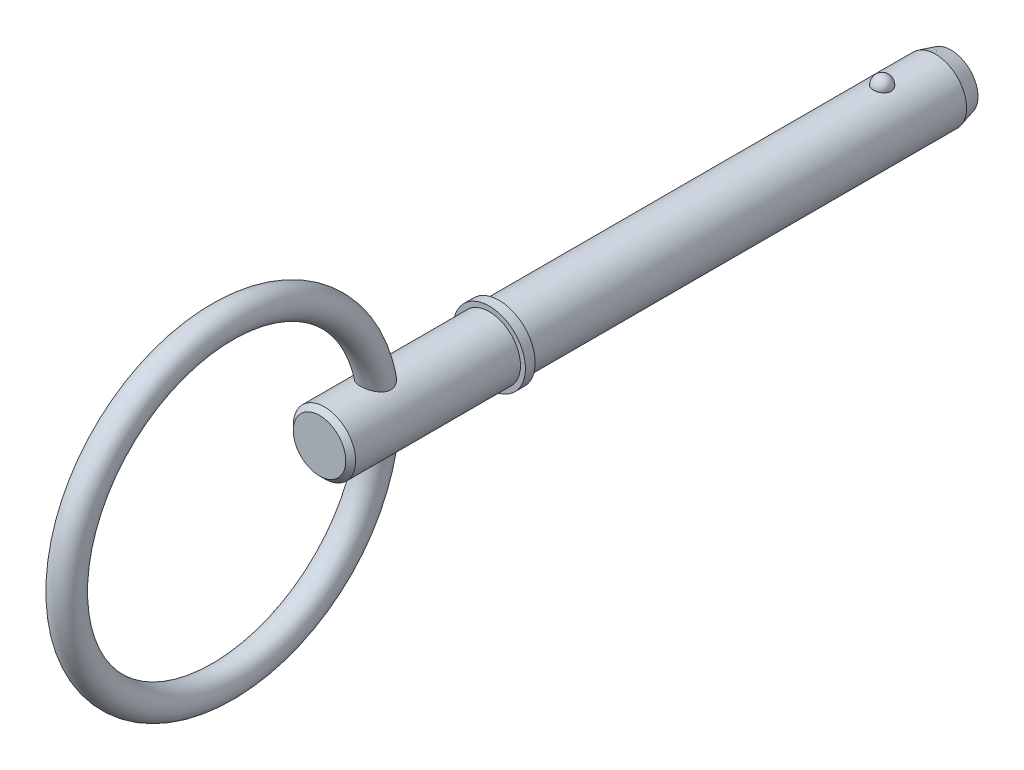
from build123d import *

# Parameters (mm, degrees)
SKETCH2_R           = 3.175
BOSS_EXTRUDE1_DEPTH = 38.1
BOSS_EXTRUDE2_START = 7.92
SKETCH3_R           = 3.175
BOSS_EXTRUDE2_DEPTH = 7.92
CHAMFER1_SIZE       = 1.586
CHAMFER1_SIZE2      = 0.424967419
SKETCH20_W          = 1
SKETCH20_H          = 3.675
SKETCH21_R          = 3.175
BOSS_EXTRUDE3_DEPTH = 18.29
CHAMFER2_SIZE       = 0.5
SKETCH24_R          = 1.5


with BuildPart() as part:
    # Sketch2 → Boss-Extrude1 (new body)
    with BuildSketch(Plane.XY):
        with Locations(Location((0, 0, 0), (0, 0, 180))):
            Circle(SKETCH2_R)
    extrude(amount=BOSS_EXTRUDE1_DEPTH)

    # Sketch3 → Boss-Extrude2 (add)
    with BuildSketch(Plane(origin=(0, 0, 0), x_dir=(-1, 0, 0), z_dir=(0, 0, -1)).offset(BOSS_EXTRUDE2_START)):
        Circle(SKETCH3_R)
    extrude(amount=-BOSS_EXTRUDE2_DEPTH)

    # Chamfer1
    chamfer1_edges = [part.edges().sort_by_distance(p)[0] for p in [
        (3.175, 0, -7.92),
    ]]
    chamfer1_side = [part.faces().sort_by_distance(p)[0] for p in [
        (3.175, 0, 15.09),
    ]]
    chamfer(chamfer1_edges, length=CHAMFER1_SIZE, length2=CHAMFER1_SIZE2, reference=chamfer1_side[0])

    # Sketch18 → Revolve1 (revolve)
    with BuildSketch(Plane(origin=(0, 0, 0), x_dir=(0, 0, -1), z_dir=(1, 0, 0))):
        with BuildLine():
            Line((0.91, 4.085), (0.91, 2.265))
            ThreePointArc((0.91, 2.265), (0, 3.175), (0.91, 4.085))
        make_face()
    revolve(axis=Axis((0, 4.085, -0.91), (0, -1, 0)))

    # Sketch20 → Revolve2 (revolve)
    with BuildSketch(Plane(origin=(0, 0, 0), x_dir=(0, 0, -1), z_dir=(1, 0, 0)), mode=Mode.PRIVATE) as revolve2_sk:
        with Locations((-38.6, 1.8375)):
            Rectangle(SKETCH20_W, SKETCH20_H)
    revolve(revolve2_sk.sketch.rotate(Axis((0, 0, 33.728787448), (0, 0, 1)), 270), axis=Axis((0, 0, 33.728787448), (0, 0, 1)))

    # Sketch21 → Boss-Extrude3 (add)
    with BuildSketch(Plane(origin=(0, 0, 38.1), x_dir=(-1, 0, 0), z_dir=(0, 0, -1))):
        with Locations(Location((0, 0, 0), (0, 0, 180))):
            Circle(SKETCH21_R)
    extrude(amount=-BOSS_EXTRUDE3_DEPTH)

    # Chamfer2
    chamfer2_edges = [part.edges().sort_by_distance(p)[0] for p in [
        (-3.175, 0, 56.39),
    ]]
    chamfer(chamfer2_edges, length=CHAMFER2_SIZE)

    # Sweep1: sweep along a path in Sketch23
    with BuildLine(Plane(origin=(0, 0, 0), x_dir=(0, 0, -1), z_dir=(1, 0, 0))) as sweep1_path:
        CenterArc((-66.265, 0), 15.875, 0, 360)
    # Sketch24 → Sweep1 (sweep)
    with BuildSketch(Plane(origin=(0, 0, 0), x_dir=(1, 0, 0), z_dir=(0, 1, 0))):
        with Locations((0, -50.39)):
            Circle(SKETCH24_R)
    sweep(path=sweep1_path.line)


solid = part.part
